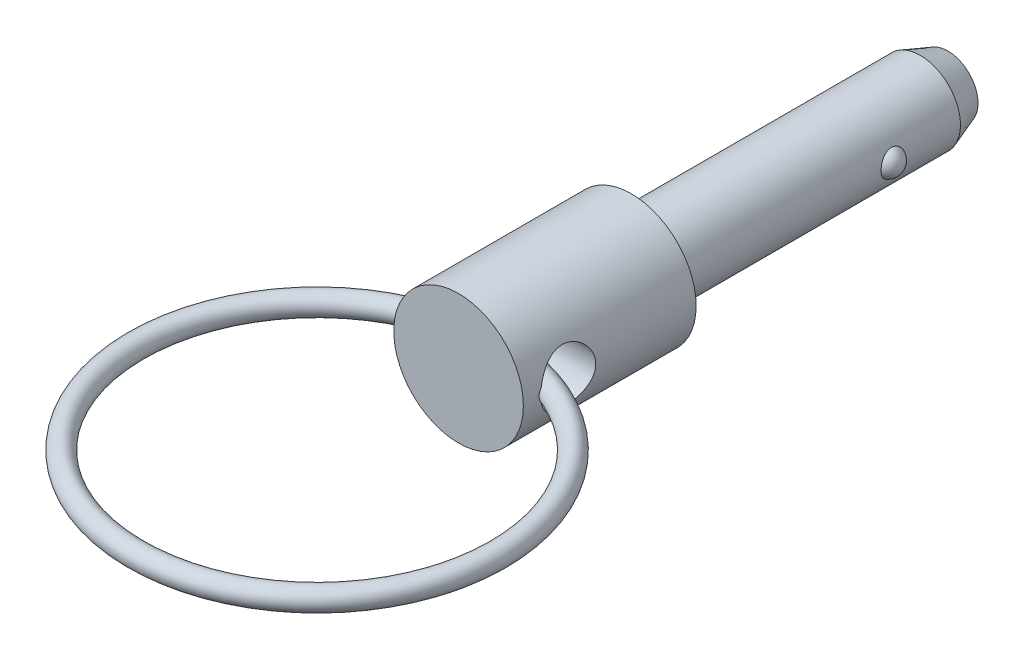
ISO-10303-21;
HEADER;
FILE_DESCRIPTION(('STEP AP214'),'2;1');
FILE_NAME('part.step','',(''),(''),'','','');
FILE_SCHEMA(('AUTOMOTIVE_DESIGN { 1 0 10303 214 1 1 1 1 }'));
ENDSEC;
DATA;
#1=APPLICATION_CONTEXT('core data for automotive mechanical design processes');
#2=APPLICATION_PROTOCOL_DEFINITION('international standard','automotive_design',2000,#1);
#3=PRODUCT_CONTEXT('',#1,'mechanical');
#4=PRODUCT('Part','Part','',(#3));
#5=PRODUCT_RELATED_PRODUCT_CATEGORY('part','',(#4));
#6=PRODUCT_DEFINITION_FORMATION('','',#4);
#7=PRODUCT_DEFINITION_CONTEXT('part definition',#1,'design');
#8=PRODUCT_DEFINITION('design','',#6,#7);
#9=PRODUCT_DEFINITION_SHAPE('','',#8);
#10=(LENGTH_UNIT() NAMED_UNIT(*) SI_UNIT(.MILLI.,.METRE.));
#11=(NAMED_UNIT(*) PLANE_ANGLE_UNIT() SI_UNIT($,.RADIAN.));
#12=(NAMED_UNIT(*) SI_UNIT($,.STERADIAN.) SOLID_ANGLE_UNIT());
#13=UNCERTAINTY_MEASURE_WITH_UNIT(LENGTH_MEASURE(1.E-05),#10,'distance_accuracy_value','');
#14=(GEOMETRIC_REPRESENTATION_CONTEXT(3) GLOBAL_UNCERTAINTY_ASSIGNED_CONTEXT((#13)) GLOBAL_UNIT_ASSIGNED_CONTEXT((#10,
#11,#12)) REPRESENTATION_CONTEXT('',''));
#15=CARTESIAN_POINT('',(0.,0.,0.));
#16=DIRECTION('',(0.,0.,1.));
#17=DIRECTION('',(1.,0.,0.));
#18=AXIS2_PLACEMENT_3D('',#15,#16,#17);
#19=CARTESIAN_POINT('',(6.35,0.,9.398));
#20=DIRECTION('',(-1.,0.,0.));
#21=DIRECTION('',(0.,0.,-1.));
#22=AXIS2_PLACEMENT_3D('',#19,#20,#21);
#23=CYLINDRICAL_SURFACE('',#22,2.0193);
#24=CARTESIAN_POINT('',(-4.76270000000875,0.49815316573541,11.3548893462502));
#25=CARTESIAN_POINT('',(-4.72833190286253,0.475048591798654,11.3607446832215));
#26=CARTESIAN_POINT('',(-4.69505034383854,0.449919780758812,11.3667299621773));
#27=CARTESIAN_POINT('',(-4.63192457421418,0.394832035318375,11.3785339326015));
#28=CARTESIAN_POINT('',(-4.60213511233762,0.364810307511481,11.3843491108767));
#29=CARTESIAN_POINT('',(-4.55535458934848,0.308281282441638,11.3937756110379));
#30=CARTESIAN_POINT('',(-4.53705372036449,0.282907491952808,11.3975656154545));
#31=CARTESIAN_POINT('',(-4.50470768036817,0.229597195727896,11.4043835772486));
#32=CARTESIAN_POINT('',(-4.49064226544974,0.201673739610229,11.4074151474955));
#33=CARTESIAN_POINT('',(-4.46975490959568,0.148629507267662,11.4119668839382));
#34=CARTESIAN_POINT('',(-4.46210314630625,0.123852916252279,11.413657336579));
#35=CARTESIAN_POINT('',(-4.45097170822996,0.0733134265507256,11.4161269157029));
#36=CARTESIAN_POINT('',(-4.4474922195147,0.0475504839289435,11.4169060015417));
#37=CARTESIAN_POINT('',(-4.44500621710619,-0.0042594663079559,11.4174619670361));
#38=CARTESIAN_POINT('',(-4.44600914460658,-0.0303069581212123,11.4172367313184));
#39=CARTESIAN_POINT('',(-4.45241947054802,-0.0818207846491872,11.4158064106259));
#40=CARTESIAN_POINT('',(-4.45782777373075,-0.107286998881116,11.414601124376));
#41=CARTESIAN_POINT('',(-4.47240849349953,-0.156294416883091,11.4113883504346));
#42=CARTESIAN_POINT('',(-4.48147591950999,-0.179868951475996,11.4094032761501));
#43=CARTESIAN_POINT('',(-4.50279050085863,-0.225454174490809,11.404805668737));
#44=CARTESIAN_POINT('',(-4.51503925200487,-0.247464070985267,11.4021928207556));
#45=CARTESIAN_POINT('',(-4.55011891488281,-0.302206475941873,11.394845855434));
#46=CARTESIAN_POINT('',(-4.57493397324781,-0.333621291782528,11.3897686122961));
#47=CARTESIAN_POINT('',(-4.62912866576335,-0.392111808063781,11.3790894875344));
#48=CARTESIAN_POINT('',(-4.65852008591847,-0.419175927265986,11.3734862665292));
#49=CARTESIAN_POINT('',(-4.71307862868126,-0.463335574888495,11.3635175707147));
#50=CARTESIAN_POINT('',(-4.73757440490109,-0.481267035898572,11.3591766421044));
#51=CARTESIAN_POINT('',(-4.76270000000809,-0.498153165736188,11.35488934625));
#52=B_SPLINE_CURVE_WITH_KNOTS('',3,(#24,#25,#26,#27,#28,#29,#30,#31,#32,#33,#34,#35,#36,#37,#38,
#39,#40,#41,#42,#43,#44,#45,#46,#47,#48,#49,#50,#51),.UNSPECIFIED.,.F.,.F.,(4,2,2,2,2,2,2,2,2,2,
2,2,2,4),(0.,0.125801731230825,0.253367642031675,0.347579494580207,0.441333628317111,
0.518959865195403,0.596589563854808,0.674382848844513,0.752192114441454,0.82791171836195,
0.90366937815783,1.02403641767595,1.14471874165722,1.23653238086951),.UNSPECIFIED.);
#53=CARTESIAN_POINT('',(-4.73813099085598,0.481166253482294,11.3591352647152));
#54=VERTEX_POINT('',#53);
#55=CARTESIAN_POINT('',(-4.73813099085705,-0.481166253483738,11.359135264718));
#56=VERTEX_POINT('',#55);
#57=EDGE_CURVE('E39',#54,#56,#52,.T.);
#58=ORIENTED_EDGE('',*,*,#57,.F.);
#59=CARTESIAN_POINT('',(-4.7625,0.,11.4173));
#60=CARTESIAN_POINT('',(-4.76249489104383,-0.108112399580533,11.4172937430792));
#61=CARTESIAN_POINT('',(-4.75878025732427,-0.216312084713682,11.4085747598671));
#62=CARTESIAN_POINT('',(-4.74429807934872,-0.429541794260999,11.3740482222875));
#63=CARTESIAN_POINT('',(-4.73352107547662,-0.534567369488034,11.3482177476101));
#64=CARTESIAN_POINT('',(-4.70606638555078,-0.73815162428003,11.280597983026));
#65=CARTESIAN_POINT('',(-4.68940628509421,-0.836728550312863,11.238856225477));
#66=CARTESIAN_POINT('',(-4.65179514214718,-1.02541561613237,11.1408163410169));
#67=CARTESIAN_POINT('',(-4.63084399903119,-1.11552555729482,11.0845178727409));
#68=CARTESIAN_POINT('',(-4.58553515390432,-1.28946876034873,10.9559107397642));
#69=CARTESIAN_POINT('',(-4.56106355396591,-1.37280723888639,10.8829734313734));
#70=CARTESIAN_POINT('',(-4.51195602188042,-1.52649281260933,10.7244940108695));
#71=CARTESIAN_POINT('',(-4.48732001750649,-1.59683374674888,10.638945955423));
#72=CARTESIAN_POINT('',(-4.43925108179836,-1.7261116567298,10.4523438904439));
#73=CARTESIAN_POINT('',(-4.41594507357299,-1.78427664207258,10.3507188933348));
#74=CARTESIAN_POINT('',(-4.37499469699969,-1.88246618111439,10.1379969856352));
#75=CARTESIAN_POINT('',(-4.35734737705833,-1.92250019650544,10.0269050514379));
#76=CARTESIAN_POINT('',(-4.33095312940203,-1.98122376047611,9.80411364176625));
#77=CARTESIAN_POINT('',(-4.32180970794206,-2.0008697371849,9.69271508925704));
#78=CARTESIAN_POINT('',(-4.31232297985,-2.02124136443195,9.46785625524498));
#79=CARTESIAN_POINT('',(-4.31197457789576,-2.02197796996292,9.35439720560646));
#80=CARTESIAN_POINT('',(-4.31978298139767,-2.00522830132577,9.13832342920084));
#81=CARTESIAN_POINT('',(-4.32726229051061,-1.98919366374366,9.03556669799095));
#82=CARTESIAN_POINT('',(-4.34873498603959,-1.94179810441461,8.83436976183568));
#83=CARTESIAN_POINT('',(-4.36272967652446,-1.91043411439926,8.73593042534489));
#84=CARTESIAN_POINT('',(-4.39597564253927,-1.83265370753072,8.54363008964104));
#85=CARTESIAN_POINT('',(-4.41533413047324,-1.7859262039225,8.44991428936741));
#86=CARTESIAN_POINT('',(-4.45710273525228,-1.67896759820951,8.27128429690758));
#87=CARTESIAN_POINT('',(-4.47951396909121,-1.61873154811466,8.1863733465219));
#88=CARTESIAN_POINT('',(-4.52725353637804,-1.48026834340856,8.0199216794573));
#89=CARTESIAN_POINT('',(-4.55266534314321,-1.40092677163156,7.93932933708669));
#90=CARTESIAN_POINT('',(-4.60189767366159,-1.22958667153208,7.79224755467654));
#91=CARTESIAN_POINT('',(-4.62571737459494,-1.13758167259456,7.72576536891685));
#92=CARTESIAN_POINT('',(-4.66982369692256,-0.94052978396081,7.6073238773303));
#93=CARTESIAN_POINT('',(-4.69000583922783,-0.835212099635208,7.55577397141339));
#94=CARTESIAN_POINT('',(-4.72372878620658,-0.616416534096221,7.47153070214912));
#95=CARTESIAN_POINT('',(-4.73728278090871,-0.502955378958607,7.43879986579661));
#96=CARTESIAN_POINT('',(-4.75192155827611,-0.323662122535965,7.40374908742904));
#97=CARTESIAN_POINT('',(-4.75587275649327,-0.259363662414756,7.39437239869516));
#98=CARTESIAN_POINT('',(-4.76116348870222,-0.130053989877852,7.38184603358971));
#99=CARTESIAN_POINT('',(-4.76250307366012,-0.0650427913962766,7.3786962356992));
#100=CARTESIAN_POINT('',(-4.76249489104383,0.10811239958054,7.37870625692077));
#101=CARTESIAN_POINT('',(-4.75878025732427,0.21631208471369,7.38742524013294));
#102=CARTESIAN_POINT('',(-4.74429807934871,0.429541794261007,7.42195177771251));
#103=CARTESIAN_POINT('',(-4.73352107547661,0.534567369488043,7.44778225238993));
#104=CARTESIAN_POINT('',(-4.70606638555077,0.738151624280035,7.51540201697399));
#105=CARTESIAN_POINT('',(-4.68940628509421,0.836728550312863,7.55714377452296));
#106=CARTESIAN_POINT('',(-4.65179514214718,1.02541561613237,7.65518365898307));
#107=CARTESIAN_POINT('',(-4.63084399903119,1.11552555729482,7.71148212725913));
#108=CARTESIAN_POINT('',(-4.58553515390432,1.28946876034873,7.84008926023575));
#109=CARTESIAN_POINT('',(-4.56106355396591,1.37280723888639,7.91302656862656));
#110=CARTESIAN_POINT('',(-4.51195602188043,1.52649281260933,8.07150598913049));
#111=CARTESIAN_POINT('',(-4.48732001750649,1.59683374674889,8.15705404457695));
#112=CARTESIAN_POINT('',(-4.43925108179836,1.7261116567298,8.3436561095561));
#113=CARTESIAN_POINT('',(-4.41594507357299,1.78427664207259,8.44528110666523));
#114=CARTESIAN_POINT('',(-4.37499469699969,1.88246618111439,8.65800301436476));
#115=CARTESIAN_POINT('',(-4.35734737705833,1.92250019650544,8.76909494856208));
#116=CARTESIAN_POINT('',(-4.33095312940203,1.98122376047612,8.99188635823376));
#117=CARTESIAN_POINT('',(-4.32180970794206,2.00086973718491,9.10328491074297));
#118=CARTESIAN_POINT('',(-4.31232297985,2.02124136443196,9.32814374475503));
#119=CARTESIAN_POINT('',(-4.31197457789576,2.02197796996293,9.44160279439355));
#120=CARTESIAN_POINT('',(-4.31978298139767,2.00522830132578,9.65767657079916));
#121=CARTESIAN_POINT('',(-4.32726229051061,1.98919366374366,9.76043330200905));
#122=CARTESIAN_POINT('',(-4.34873498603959,1.94179810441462,9.96163023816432));
#123=CARTESIAN_POINT('',(-4.36272967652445,1.91043411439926,10.0600695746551));
#124=CARTESIAN_POINT('',(-4.39597564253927,1.83265370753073,10.252369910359));
#125=CARTESIAN_POINT('',(-4.41533413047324,1.78592620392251,10.3460857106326));
#126=CARTESIAN_POINT('',(-4.45710273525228,1.67896759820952,10.5247157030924));
#127=CARTESIAN_POINT('',(-4.47951396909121,1.61873154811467,10.6096266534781));
#128=CARTESIAN_POINT('',(-4.52725353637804,1.48026834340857,10.7760783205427));
#129=CARTESIAN_POINT('',(-4.55266534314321,1.40092677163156,10.8566706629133));
#130=CARTESIAN_POINT('',(-4.60189767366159,1.22958667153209,11.0037524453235));
#131=CARTESIAN_POINT('',(-4.62571737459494,1.13758167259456,11.0702346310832));
#132=CARTESIAN_POINT('',(-4.66982369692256,0.940529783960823,11.1886761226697));
#133=CARTESIAN_POINT('',(-4.69000583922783,0.835212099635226,11.2402260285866));
#134=CARTESIAN_POINT('',(-4.72372878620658,0.616416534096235,11.3244692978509));
#135=CARTESIAN_POINT('',(-4.73728278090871,0.502955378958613,11.3572001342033));
#136=CARTESIAN_POINT('',(-4.75192155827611,0.323662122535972,11.3922509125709));
#137=CARTESIAN_POINT('',(-4.75587275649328,0.259363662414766,11.4016276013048));
#138=CARTESIAN_POINT('',(-4.76116348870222,0.130053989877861,11.4141539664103));
#139=CARTESIAN_POINT('',(-4.76250307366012,0.0650427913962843,11.4173037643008));
#140=CARTESIAN_POINT('',(-4.7625,0.,11.4173));
#141=B_SPLINE_CURVE_WITH_KNOTS('',3,(#59,#60,#61,#62,#63,#64,#65,#66,#67,#68,#69,#70,#71,#72,
#73,#74,#75,#76,#77,#78,#79,#80,#81,#82,#83,#84,#85,#86,#87,#88,#89,#90,#91,#92,#93,#94,#95,#96,
#97,#98,#99,#100,#101,#102,#103,#104,#105,#106,#107,#108,#109,#110,#111,#112,#113,#114,#115,
#116,#117,#118,#119,#120,#121,#122,#123,#124,#125,#126,#127,#128,#129,#130,#131,#132,#133,#134,
#135,#136,#137,#138,#139,#140),.UNSPECIFIED.,.T.,.F.,(4,2,2,2,2,2,2,2,2,2,2,2,2,2,2,2,2,2,2,2,2,
2,2,2,2,2,2,2,2,2,2,2,2,2,2,2,2,2,2,2,4),(0.,0.324084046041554,0.648603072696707,
0.972160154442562,1.29572482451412,1.63451297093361,1.97346129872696,2.32983137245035,
2.68601525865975,3.02460962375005,3.36300782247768,3.6743618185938,3.98577815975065,
4.30393445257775,4.6222074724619,4.96838833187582,5.31474674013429,5.66985671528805,
6.02425711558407,6.21923699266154,6.41421306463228,6.73829711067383,7.06281613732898,
7.38637321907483,7.70993788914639,8.04872603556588,8.38767436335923,8.74404443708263,
9.10022832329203,9.43882268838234,9.77722088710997,10.0885748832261,10.3999912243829,
10.71814751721,11.0364205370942,11.3826013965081,11.7289598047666,12.0840697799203,
12.4384701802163,12.6334500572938,12.8284261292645),.UNSPECIFIED.);
#142=EDGE_CURVE('E53',#56,#54,#141,.T.);
#143=ORIENTED_EDGE('',*,*,#142,.F.);
#144=EDGE_LOOP('',(#58,#143));
#145=FACE_BOUND('',#144,.T.);
#146=CARTESIAN_POINT('',(4.76270000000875,-0.498153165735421,11.3548893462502));
#147=CARTESIAN_POINT('',(4.72833190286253,-0.475048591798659,11.3607446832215));
#148=CARTESIAN_POINT('',(4.69505034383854,-0.449919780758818,11.3667299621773));
#149=CARTESIAN_POINT('',(4.63192457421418,-0.394832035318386,11.3785339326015));
#150=CARTESIAN_POINT('',(4.60213511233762,-0.364810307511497,11.3843491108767));
#151=CARTESIAN_POINT('',(4.55535458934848,-0.308281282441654,11.3937756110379));
#152=CARTESIAN_POINT('',(4.53705372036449,-0.282907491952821,11.3975656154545));
#153=CARTESIAN_POINT('',(4.50470768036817,-0.229597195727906,11.4043835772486));
#154=CARTESIAN_POINT('',(4.49064226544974,-0.201673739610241,11.4074151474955));
#155=CARTESIAN_POINT('',(4.46975490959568,-0.148629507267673,11.4119668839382));
#156=CARTESIAN_POINT('',(4.46210314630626,-0.123852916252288,11.413657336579));
#157=CARTESIAN_POINT('',(4.45097170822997,-0.0733134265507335,11.4161269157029));
#158=CARTESIAN_POINT('',(4.44749221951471,-0.0475504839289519,11.4169060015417));
#159=CARTESIAN_POINT('',(4.44500621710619,0.00425946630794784,11.4174619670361));
#160=CARTESIAN_POINT('',(4.44600914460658,0.030306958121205,11.4172367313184));
#161=CARTESIAN_POINT('',(4.45241947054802,0.0818207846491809,11.4158064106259));
#162=CARTESIAN_POINT('',(4.45782777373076,0.107286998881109,11.414601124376));
#163=CARTESIAN_POINT('',(4.47240849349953,0.156294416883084,11.4113883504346));
#164=CARTESIAN_POINT('',(4.48147591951,0.179868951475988,11.4094032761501));
#165=CARTESIAN_POINT('',(4.50279050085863,0.225454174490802,11.404805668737));
#166=CARTESIAN_POINT('',(4.51503925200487,0.247464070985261,11.4021928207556));
#167=CARTESIAN_POINT('',(4.55011891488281,0.302206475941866,11.394845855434));
#168=CARTESIAN_POINT('',(4.57493397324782,0.333621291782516,11.3897686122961));
#169=CARTESIAN_POINT('',(4.62912866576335,0.392111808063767,11.3790894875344));
#170=CARTESIAN_POINT('',(4.65852008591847,0.419175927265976,11.3734862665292));
#171=CARTESIAN_POINT('',(4.71307862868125,0.463335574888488,11.3635175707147));
#172=CARTESIAN_POINT('',(4.73757440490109,0.481267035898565,11.3591766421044));
#173=CARTESIAN_POINT('',(4.76270000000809,0.498153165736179,11.3548893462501));
#174=B_SPLINE_CURVE_WITH_KNOTS('',3,(#146,#147,#148,#149,#150,#151,#152,#153,#154,#155,#156,
#157,#158,#159,#160,#161,#162,#163,#164,#165,#166,#167,#168,#169,#170,#171,#172,#173),
.UNSPECIFIED.,.F.,.F.,(4,2,2,2,2,2,2,2,2,2,2,2,2,4),(0.,0.125801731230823,0.253367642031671,
0.347579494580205,0.44133362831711,0.518959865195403,0.596589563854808,0.674382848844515,
0.752192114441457,0.827911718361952,0.903669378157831,1.02403641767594,1.14471874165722,
1.2365323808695),.UNSPECIFIED.);
#175=CARTESIAN_POINT('',(4.73813099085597,-0.481166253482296,11.3591352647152));
#176=VERTEX_POINT('',#175);
#177=CARTESIAN_POINT('',(4.73813099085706,0.481166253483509,11.359135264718));
#178=VERTEX_POINT('',#177);
#179=EDGE_CURVE('E32',#176,#178,#174,.T.);
#180=ORIENTED_EDGE('',*,*,#179,.F.);
#181=CARTESIAN_POINT('',(4.7625,0.,7.3787));
#182=CARTESIAN_POINT('',(4.76249489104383,-0.108112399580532,7.37870625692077));
#183=CARTESIAN_POINT('',(4.75878025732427,-0.216312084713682,7.38742524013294));
#184=CARTESIAN_POINT('',(4.74429807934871,-0.429541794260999,7.42195177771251));
#185=CARTESIAN_POINT('',(4.73352107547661,-0.534567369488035,7.44778225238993));
#186=CARTESIAN_POINT('',(4.70606638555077,-0.738151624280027,7.51540201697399));
#187=CARTESIAN_POINT('',(4.68940628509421,-0.836728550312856,7.55714377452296));
#188=CARTESIAN_POINT('',(4.65179514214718,-1.02541561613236,7.65518365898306));
#189=CARTESIAN_POINT('',(4.63084399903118,-1.11552555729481,7.71148212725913));
#190=CARTESIAN_POINT('',(4.58553515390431,-1.28946876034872,7.84008926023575));
#191=CARTESIAN_POINT('',(4.5610635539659,-1.37280723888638,7.91302656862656));
#192=CARTESIAN_POINT('',(4.51195602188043,-1.52649281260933,8.0715059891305));
#193=CARTESIAN_POINT('',(4.48732001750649,-1.59683374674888,8.15705404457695));
#194=CARTESIAN_POINT('',(4.43925108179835,-1.7261116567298,8.3436561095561));
#195=CARTESIAN_POINT('',(4.41594507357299,-1.78427664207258,8.44528110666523));
#196=CARTESIAN_POINT('',(4.37499469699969,-1.88246618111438,8.65800301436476));
#197=CARTESIAN_POINT('',(4.35734737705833,-1.92250019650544,8.76909494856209));
#198=CARTESIAN_POINT('',(4.33095312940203,-1.98122376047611,8.99188635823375));
#199=CARTESIAN_POINT('',(4.32180970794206,-2.0008697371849,9.10328491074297));
#200=CARTESIAN_POINT('',(4.31232297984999,-2.02124136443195,9.32814374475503));
#201=CARTESIAN_POINT('',(4.31197457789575,-2.02197796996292,9.44160279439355));
#202=CARTESIAN_POINT('',(4.31978298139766,-2.00522830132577,9.65767657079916));
#203=CARTESIAN_POINT('',(4.32726229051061,-1.98919366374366,9.76043330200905));
#204=CARTESIAN_POINT('',(4.34873498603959,-1.94179810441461,9.96163023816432));
#205=CARTESIAN_POINT('',(4.36272967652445,-1.91043411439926,10.0600695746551));
#206=CARTESIAN_POINT('',(4.39597564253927,-1.83265370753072,10.252369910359));
#207=CARTESIAN_POINT('',(4.41533413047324,-1.7859262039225,10.3460857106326));
#208=CARTESIAN_POINT('',(4.45710273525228,-1.67896759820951,10.5247157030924));
#209=CARTESIAN_POINT('',(4.4795139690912,-1.61873154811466,10.6096266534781));
#210=CARTESIAN_POINT('',(4.52725353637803,-1.48026834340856,10.7760783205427));
#211=CARTESIAN_POINT('',(4.55266534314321,-1.40092677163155,10.8566706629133));
#212=CARTESIAN_POINT('',(4.60189767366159,-1.22958667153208,11.0037524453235));
#213=CARTESIAN_POINT('',(4.62571737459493,-1.13758167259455,11.0702346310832));
#214=CARTESIAN_POINT('',(4.66982369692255,-0.940529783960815,11.1886761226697));
#215=CARTESIAN_POINT('',(4.69000583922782,-0.835212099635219,11.2402260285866));
#216=CARTESIAN_POINT('',(4.72372878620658,-0.616416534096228,11.3244692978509));
#217=CARTESIAN_POINT('',(4.7372827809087,-0.502955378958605,11.3572001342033));
#218=CARTESIAN_POINT('',(4.75192155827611,-0.323662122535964,11.3922509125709));
#219=CARTESIAN_POINT('',(4.75587275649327,-0.259363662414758,11.4016276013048));
#220=CARTESIAN_POINT('',(4.76116348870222,-0.130053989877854,11.4141539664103));
#221=CARTESIAN_POINT('',(4.76250307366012,-0.0650427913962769,11.4173037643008));
#222=CARTESIAN_POINT('',(4.76249489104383,0.108112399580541,11.4172937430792));
#223=CARTESIAN_POINT('',(4.75878025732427,0.21631208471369,11.4085747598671));
#224=CARTESIAN_POINT('',(4.74429807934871,0.429541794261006,11.3740482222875));
#225=CARTESIAN_POINT('',(4.73352107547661,0.534567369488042,11.3482177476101));
#226=CARTESIAN_POINT('',(4.70606638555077,0.738151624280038,11.280597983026));
#227=CARTESIAN_POINT('',(4.68940628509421,0.836728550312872,11.238856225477));
#228=CARTESIAN_POINT('',(4.65179514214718,1.02541561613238,11.1408163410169));
#229=CARTESIAN_POINT('',(4.63084399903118,1.11552555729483,11.0845178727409));
#230=CARTESIAN_POINT('',(4.58553515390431,1.28946876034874,10.9559107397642));
#231=CARTESIAN_POINT('',(4.5610635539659,1.3728072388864,10.8829734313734));
#232=CARTESIAN_POINT('',(4.51195602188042,1.52649281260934,10.7244940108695));
#233=CARTESIAN_POINT('',(4.48732001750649,1.59683374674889,10.638945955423));
#234=CARTESIAN_POINT('',(4.43925108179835,1.72611165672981,10.4523438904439));
#235=CARTESIAN_POINT('',(4.41594507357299,1.78427664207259,10.3507188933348));
#236=CARTESIAN_POINT('',(4.37499469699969,1.88246618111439,10.1379969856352));
#237=CARTESIAN_POINT('',(4.35734737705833,1.92250019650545,10.0269050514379));
#238=CARTESIAN_POINT('',(4.33095312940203,1.98122376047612,9.80411364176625));
#239=CARTESIAN_POINT('',(4.32180970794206,2.00086973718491,9.69271508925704));
#240=CARTESIAN_POINT('',(4.31232297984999,2.02124136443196,9.46785625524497));
#241=CARTESIAN_POINT('',(4.31197457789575,2.02197796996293,9.35439720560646));
#242=CARTESIAN_POINT('',(4.31978298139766,2.00522830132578,9.13832342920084));
#243=CARTESIAN_POINT('',(4.32726229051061,1.98919366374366,9.03556669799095));
#244=CARTESIAN_POINT('',(4.34873498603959,1.94179810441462,8.83436976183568));
#245=CARTESIAN_POINT('',(4.36272967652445,1.91043411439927,8.73593042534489));
#246=CARTESIAN_POINT('',(4.39597564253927,1.83265370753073,8.54363008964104));
#247=CARTESIAN_POINT('',(4.41533413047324,1.7859262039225,8.44991428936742));
#248=CARTESIAN_POINT('',(4.45710273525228,1.67896759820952,8.27128429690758));
#249=CARTESIAN_POINT('',(4.47951396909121,1.61873154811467,8.1863733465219));
#250=CARTESIAN_POINT('',(4.52725353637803,1.48026834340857,8.0199216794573));
#251=CARTESIAN_POINT('',(4.55266534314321,1.40092677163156,7.93932933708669));
#252=CARTESIAN_POINT('',(4.60189767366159,1.22958667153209,7.79224755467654));
#253=CARTESIAN_POINT('',(4.62571737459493,1.13758167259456,7.72576536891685));
#254=CARTESIAN_POINT('',(4.66982369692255,0.940529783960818,7.6073238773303));
#255=CARTESIAN_POINT('',(4.69000583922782,0.835212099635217,7.55577397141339));
#256=CARTESIAN_POINT('',(4.72372878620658,0.616416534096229,7.47153070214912));
#257=CARTESIAN_POINT('',(4.7372827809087,0.502955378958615,7.43879986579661));
#258=CARTESIAN_POINT('',(4.75192155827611,0.323662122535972,7.40374908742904));
#259=CARTESIAN_POINT('',(4.75587275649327,0.259363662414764,7.39437239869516));
#260=CARTESIAN_POINT('',(4.76116348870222,0.130053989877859,7.38184603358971));
#261=CARTESIAN_POINT('',(4.76250307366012,0.0650427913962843,7.3786962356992));
#262=CARTESIAN_POINT('',(4.7625,0.,7.3787));
#263=B_SPLINE_CURVE_WITH_KNOTS('',3,(#181,#182,#183,#184,#185,#186,#187,#188,#189,#190,#191,
#192,#193,#194,#195,#196,#197,#198,#199,#200,#201,#202,#203,#204,#205,#206,#207,#208,#209,#210,
#211,#212,#213,#214,#215,#216,#217,#218,#219,#220,#221,#222,#223,#224,#225,#226,#227,#228,#229,
#230,#231,#232,#233,#234,#235,#236,#237,#238,#239,#240,#241,#242,#243,#244,#245,#246,#247,#248,
#249,#250,#251,#252,#253,#254,#255,#256,#257,#258,#259,#260,#261,#262),.UNSPECIFIED.,.T.,.F.,(4,
2,2,2,2,2,2,2,2,2,2,2,2,2,2,2,2,2,2,2,2,2,2,2,2,2,2,2,2,2,2,2,2,2,2,2,2,2,2,2,4),(0.,
0.324084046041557,0.648603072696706,0.972160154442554,1.29572482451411,1.63451297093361,
1.97346129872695,2.32983137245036,2.68601525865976,3.02460962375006,3.3630078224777,
3.6743618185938,3.98577815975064,4.30393445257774,4.6222074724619,4.96838833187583,
5.31474674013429,5.66985671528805,6.02425711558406,6.21923699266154,6.41421306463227,
6.73829711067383,7.06281613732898,7.38637321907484,7.7099378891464,8.04872603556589,
8.38767436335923,8.74404443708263,9.10022832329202,9.43882268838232,9.77722088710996,
10.0885748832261,10.3999912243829,10.71814751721,11.0364205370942,11.3826013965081,
11.7289598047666,12.0840697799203,12.4384701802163,12.6334500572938,12.8284261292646),.UNSPECIFIED.);
#264=EDGE_CURVE('E49',#178,#176,#263,.T.);
#265=ORIENTED_EDGE('',*,*,#264,.F.);
#266=EDGE_LOOP('',(#180,#265));
#267=FACE_BOUND('',#266,.T.);
#268=ADVANCED_FACE('F14',(#145,#267),#23,.F.);
#269=CARTESIAN_POINT('',(0.,0.,-23.2664));
#270=DIRECTION('',(0.,0.,-1.));
#271=DIRECTION('',(1.,0.,0.));
#272=AXIS2_PLACEMENT_3D('',#269,#270,#271);
#273=CYLINDRICAL_SURFACE('',#272,4.7625);
#274=ORIENTED_EDGE('',*,*,#264,.T.);
#275=CARTESIAN_POINT('',(4.75672783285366,-0.234410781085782,9.86389096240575));
#276=CARTESIAN_POINT('',(4.75463715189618,-0.276823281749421,9.87695364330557));
#277=CARTESIAN_POINT('',(4.75202741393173,-0.318142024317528,9.89358560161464));
#278=CARTESIAN_POINT('',(4.74605906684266,-0.397384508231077,9.93354154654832));
#279=CARTESIAN_POINT('',(4.74269965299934,-0.435304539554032,9.95687273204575));
#280=CARTESIAN_POINT('',(4.7356117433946,-0.506628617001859,10.0095466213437));
#281=CARTESIAN_POINT('',(4.731883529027,-0.540036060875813,10.0388847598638));
#282=CARTESIAN_POINT('',(4.7244690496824,-0.601463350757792,10.1027270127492));
#283=CARTESIAN_POINT('',(4.72078277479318,-0.629484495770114,10.1372298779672));
#284=CARTESIAN_POINT('',(4.71381973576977,-0.679675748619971,10.2106969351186));
#285=CARTESIAN_POINT('',(4.71054647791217,-0.70179733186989,10.2496945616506));
#286=CARTESIAN_POINT('',(4.70478201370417,-0.73945712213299,10.3307970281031));
#287=CARTESIAN_POINT('',(4.7022909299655,-0.754994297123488,10.3729023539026));
#288=CARTESIAN_POINT('',(4.69825743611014,-0.77970948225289,10.4605198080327));
#289=CARTESIAN_POINT('',(4.69674995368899,-0.788654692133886,10.5060989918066));
#290=CARTESIAN_POINT('',(4.69494168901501,-0.799348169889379,10.5981124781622));
#291=CARTESIAN_POINT('',(4.69464124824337,-0.801094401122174,10.6445470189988));
#292=CARTESIAN_POINT('',(4.69525593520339,-0.797484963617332,10.7400273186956));
#293=CARTESIAN_POINT('',(4.6962479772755,-0.7916799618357,10.7890554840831));
#294=CARTESIAN_POINT('',(4.69943436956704,-0.772538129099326,10.88558205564));
#295=CARTESIAN_POINT('',(4.70162918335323,-0.759198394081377,10.9330798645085));
#296=CARTESIAN_POINT('',(4.7071366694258,-0.724294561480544,11.0283694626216));
#297=CARTESIAN_POINT('',(4.71051187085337,-0.702258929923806,11.0759856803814));
#298=CARTESIAN_POINT('',(4.71792781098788,-0.6505714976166,11.1668661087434));
#299=CARTESIAN_POINT('',(4.72196879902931,-0.620916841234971,11.2101286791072));
#300=CARTESIAN_POINT('',(4.73024120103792,-0.554392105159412,11.2909794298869));
#301=CARTESIAN_POINT('',(4.73447324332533,-0.517496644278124,11.3285468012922));
#302=CARTESIAN_POINT('',(4.74255290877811,-0.437280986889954,11.3961281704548));
#303=CARTESIAN_POINT('',(4.74640083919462,-0.393965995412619,11.4261482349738));
#304=CARTESIAN_POINT('',(4.75279848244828,-0.306647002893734,11.4743172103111));
#305=CARTESIAN_POINT('',(4.7554392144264,-0.263139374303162,11.4933494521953));
#306=CARTESIAN_POINT('',(4.75956072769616,-0.173210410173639,11.5225838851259));
#307=CARTESIAN_POINT('',(4.7610430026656,-0.126792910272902,11.5327974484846));
#308=CARTESIAN_POINT('',(4.76251214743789,-0.0392228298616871,11.5429046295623));
#309=CARTESIAN_POINT('',(4.76267454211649,0.00179015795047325,11.5440098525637));
#310=CARTESIAN_POINT('',(4.76194485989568,0.0833582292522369,11.5390051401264));
#311=CARTESIAN_POINT('',(4.76105302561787,0.123913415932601,11.5328968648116));
#312=CARTESIAN_POINT('',(4.75839052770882,0.201390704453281,11.5143023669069));
#313=CARTESIAN_POINT('',(4.7566647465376,0.23839356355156,11.5021410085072));
#314=CARTESIAN_POINT('',(4.75253498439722,0.310009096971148,11.4722173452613));
#315=CARTESIAN_POINT('',(4.75013086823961,0.34462129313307,11.4544539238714));
#316=CARTESIAN_POINT('',(4.74468244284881,0.413106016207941,11.4126354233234));
#317=CARTESIAN_POINT('',(4.74160529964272,0.446760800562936,11.3882294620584));
#318=CARTESIAN_POINT('',(4.73521429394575,0.510064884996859,11.3347169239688));
#319=CARTESIAN_POINT('',(4.73190032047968,0.539712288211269,11.3056081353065));
#320=CARTESIAN_POINT('',(4.72489226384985,0.598141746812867,11.2395451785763));
#321=CARTESIAN_POINT('',(4.72120374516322,0.626328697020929,11.2020637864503));
#322=CARTESIAN_POINT('',(4.71424234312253,0.676737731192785,11.1232450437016));
#323=CARTESIAN_POINT('',(4.71096968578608,0.698956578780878,11.0819056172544));
#324=CARTESIAN_POINT('',(4.70485086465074,0.739081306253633,10.9918449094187));
#325=CARTESIAN_POINT('',(4.70208579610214,0.756287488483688,10.9428045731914));
#326=CARTESIAN_POINT('',(4.69779376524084,0.782507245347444,10.8425158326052));
#327=CARTESIAN_POINT('',(4.69626707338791,0.791519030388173,10.7912669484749));
#328=CARTESIAN_POINT('',(4.69466144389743,0.800990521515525,10.6869325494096));
#329=CARTESIAN_POINT('',(4.69461132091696,0.801280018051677,10.6338307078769));
#330=CARTESIAN_POINT('',(4.69610058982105,0.792506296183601,10.5284214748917));
#331=CARTESIAN_POINT('',(4.69763938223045,0.783446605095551,10.4761137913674));
#332=CARTESIAN_POINT('',(4.70202301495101,0.756674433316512,10.3770218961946));
#333=CARTESIAN_POINT('',(4.70478816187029,0.739486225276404,10.3300928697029));
#334=CARTESIAN_POINT('',(4.71127399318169,0.696967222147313,10.2401511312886));
#335=CARTESIAN_POINT('',(4.71499427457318,0.671639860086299,10.1971367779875));
#336=CARTESIAN_POINT('',(4.72264431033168,0.615452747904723,10.1192841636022));
#337=CARTESIAN_POINT('',(4.72654308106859,0.585080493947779,10.0840903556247));
#338=CARTESIAN_POINT('',(4.73429341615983,0.518639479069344,10.0195645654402));
#339=CARTESIAN_POINT('',(4.73814499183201,0.482572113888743,9.99023115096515));
#340=CARTESIAN_POINT('',(4.74520575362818,0.407195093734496,9.93927752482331));
#341=CARTESIAN_POINT('',(4.74843306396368,0.368048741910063,9.91741780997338));
#342=CARTESIAN_POINT('',(4.75404590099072,0.286564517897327,9.88060848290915));
#343=CARTESIAN_POINT('',(4.75643129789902,0.244226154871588,9.86565993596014));
#344=CARTESIAN_POINT('',(4.76007108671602,0.15802691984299,9.84320151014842));
#345=CARTESIAN_POINT('',(4.76133640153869,0.114185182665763,9.8356197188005));
#346=CARTESIAN_POINT('',(4.76263391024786,0.0258666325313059,9.82784590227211));
#347=CARTESIAN_POINT('',(4.76266746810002,-0.0186094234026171,9.82764570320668));
#348=CARTESIAN_POINT('',(4.76170334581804,-0.0918724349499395,9.83342133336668));
#349=CARTESIAN_POINT('',(4.76105293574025,-0.12084461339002,9.83731729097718));
#350=CARTESIAN_POINT('',(4.75925240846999,-0.178172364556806,9.84825826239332));
#351=CARTESIAN_POINT('',(4.7581022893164,-0.206527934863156,9.85530328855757));
#352=CARTESIAN_POINT('',(4.75672783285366,-0.234410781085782,9.86389096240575));
#353=B_SPLINE_CURVE_WITH_KNOTS('',3,(#275,#276,#277,#278,#279,#280,#281,#282,#283,#284,#285,
#286,#287,#288,#289,#290,#291,#292,#293,#294,#295,#296,#297,#298,#299,#300,#301,#302,#303,#304,
#305,#306,#307,#308,#309,#310,#311,#312,#313,#314,#315,#316,#317,#318,#319,#320,#321,#322,#323,
#324,#325,#326,#327,#328,#329,#330,#331,#332,#333,#334,#335,#336,#337,#338,#339,#340,#341,#342,
#343,#344,#345,#346,#347,#348,#349,#350,#351,#352),.UNSPECIFIED.,.T.,.F.,(4,2,2,2,2,2,2,2,2,2,2,
2,2,2,2,2,2,2,2,2,2,2,2,2,2,2,2,2,2,2,2,2,2,2,2,2,2,2,4),(0.,0.133176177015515,
0.266496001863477,0.399714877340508,0.532901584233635,0.667152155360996,0.801423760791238,
0.940235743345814,1.07908699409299,1.22659070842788,1.37415131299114,1.53115159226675,
1.68821080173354,1.84583071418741,2.00332351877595,2.14516294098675,2.28681917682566,
2.4092664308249,2.53168551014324,2.64814679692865,2.76463131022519,2.88919364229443,
3.01381473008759,3.15436663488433,3.29499460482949,3.45041783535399,3.60587500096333,
3.76436388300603,3.92279299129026,4.07216500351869,4.22147409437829,4.36072714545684,
4.49994612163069,4.63415709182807,4.76838874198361,4.90129648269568,5.03405704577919,
5.12160944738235,5.20916219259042),.UNSPECIFIED.);
#354=EDGE_CURVE('E26',#176,#178,#353,.T.);
#355=ORIENTED_EDGE('',*,*,#354,.T.);
#356=EDGE_LOOP('',(#274,#355));
#357=FACE_BOUND('',#356,.T.);
#358=CARTESIAN_POINT('',(0.,0.,1.13485609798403E-11));
#359=DIRECTION('',(0.,0.,-1.));
#360=DIRECTION('',(1.,0.,0.));
#361=AXIS2_PLACEMENT_3D('',#358,#359,#360);
#362=CIRCLE('',#361,4.76249999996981);
#363=CARTESIAN_POINT('',(4.76249999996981,0.,1.13483510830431E-11));
#364=VERTEX_POINT('',#363);
#365=EDGE_CURVE('E58',#364,#364,#362,.T.);
#366=ORIENTED_EDGE('',*,*,#365,.F.);
#367=EDGE_LOOP('',(#366));
#368=FACE_BOUND('',#367,.T.);
#369=CARTESIAN_POINT('',(0.,0.,12.7000000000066));
#370=DIRECTION('',(0.,0.,-1.));
#371=DIRECTION('',(1.,0.,0.));
#372=AXIS2_PLACEMENT_3D('',#369,#370,#371);
#373=CIRCLE('',#372,4.76249999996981);
#374=CARTESIAN_POINT('',(4.76249999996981,0.,12.7000000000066));
#375=VERTEX_POINT('',#374);
#376=EDGE_CURVE('E135',#375,#375,#373,.T.);
#377=ORIENTED_EDGE('',*,*,#376,.T.);
#378=EDGE_LOOP('',(#377));
#379=FACE_BOUND('',#378,.T.);
#380=ORIENTED_EDGE('',*,*,#142,.T.);
#381=CARTESIAN_POINT('',(-4.75672783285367,-0.234410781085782,9.86389096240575));
#382=CARTESIAN_POINT('',(-4.75880797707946,-0.192184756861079,9.85088943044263));
#383=CARTESIAN_POINT('',(-4.76037619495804,-0.148820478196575,9.84140883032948));
#384=CARTESIAN_POINT('',(-4.76231114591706,-0.0610623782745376,9.8297605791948));
#385=CARTESIAN_POINT('',(-4.76267662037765,-0.0166675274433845,9.82760058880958));
#386=CARTESIAN_POINT('',(-4.76216356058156,0.0718447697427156,9.83066350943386));
#387=CARTESIAN_POINT('',(-4.76128553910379,0.115962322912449,9.83588337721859));
#388=CARTESIAN_POINT('',(-4.75838343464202,0.202671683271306,9.85356395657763));
#389=CARTESIAN_POINT('',(-4.75635960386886,0.24526382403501,9.86602307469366));
#390=CARTESIAN_POINT('',(-4.75138989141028,0.327732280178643,9.89785096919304));
#391=CARTESIAN_POINT('',(-4.74844388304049,0.367608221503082,9.91722069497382));
#392=CARTESIAN_POINT('',(-4.74195662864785,0.443516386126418,9.96233891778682));
#393=CARTESIAN_POINT('',(-4.73841538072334,0.479548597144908,9.98808743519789));
#394=CARTESIAN_POINT('',(-4.73111995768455,0.546865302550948,10.0453065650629));
#395=CARTESIAN_POINT('',(-4.72736528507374,0.578138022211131,10.0767909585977));
#396=CARTESIAN_POINT('',(-4.72006096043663,0.635024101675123,10.1445276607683));
#397=CARTESIAN_POINT('',(-4.71651131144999,0.660637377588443,10.1807800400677));
#398=CARTESIAN_POINT('',(-4.70994476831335,0.705946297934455,10.2575433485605));
#399=CARTESIAN_POINT('',(-4.70693606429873,0.725553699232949,10.2981069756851));
#400=CARTESIAN_POINT('',(-4.70181675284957,0.758021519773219,10.3818966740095));
#401=CARTESIAN_POINT('',(-4.69970628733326,0.770880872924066,10.4251231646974));
#402=CARTESIAN_POINT('',(-4.69650867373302,0.790134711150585,10.5148288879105));
#403=CARTESIAN_POINT('',(-4.69546563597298,0.796251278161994,10.5613691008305));
#404=CARTESIAN_POINT('',(-4.69462220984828,0.801207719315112,10.6548424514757));
#405=CARTESIAN_POINT('',(-4.69482220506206,0.800045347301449,10.7017757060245));
#406=CARTESIAN_POINT('',(-4.69645733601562,0.790392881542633,10.7979976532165));
#407=CARTESIAN_POINT('',(-4.69797327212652,0.781423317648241,10.8472368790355));
#408=CARTESIAN_POINT('',(-4.70214662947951,0.755902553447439,10.943667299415));
#409=CARTESIAN_POINT('',(-4.70480451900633,0.73934824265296,10.9908576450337));
#410=CARTESIAN_POINT('',(-4.71113533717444,0.697907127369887,11.0846488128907));
#411=CARTESIAN_POINT('',(-4.71485784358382,0.672595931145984,11.1310597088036));
#412=CARTESIAN_POINT('',(-4.72278864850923,0.614436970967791,11.2188860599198));
#413=CARTESIAN_POINT('',(-4.72699707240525,0.581587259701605,11.2603002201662));
#414=CARTESIAN_POINT('',(-4.73530162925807,0.509526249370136,11.3359421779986));
#415=CARTESIAN_POINT('',(-4.73939847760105,0.470426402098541,11.3702753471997));
#416=CARTESIAN_POINT('',(-4.74699023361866,0.386343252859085,11.4308675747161));
#417=CARTESIAN_POINT('',(-4.75048579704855,0.341366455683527,11.457135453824));
#418=CARTESIAN_POINT('',(-4.7559922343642,0.252376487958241,11.4974010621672));
#419=CARTESIAN_POINT('',(-4.75812829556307,0.208856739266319,11.5124686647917));
#420=CARTESIAN_POINT('',(-4.76120337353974,0.119700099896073,11.5339491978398));
#421=CARTESIAN_POINT('',(-4.76214369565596,0.0740655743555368,11.540371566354));
#422=CARTESIAN_POINT('',(-4.76265411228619,-0.0117455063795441,11.54386707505));
#423=CARTESIAN_POINT('',(-4.7623828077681,-0.051880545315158,11.5420222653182));
#424=CARTESIAN_POINT('',(-4.76085712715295,-0.131220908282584,11.531508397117));
#425=CARTESIAN_POINT('',(-4.75960284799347,-0.170426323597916,11.5228400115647));
#426=CARTESIAN_POINT('',(-4.75629335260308,-0.245921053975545,11.499439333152));
#427=CARTESIAN_POINT('',(-4.75425749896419,-0.282257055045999,11.4848531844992));
#428=CARTESIAN_POINT('',(-4.74958711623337,-0.352221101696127,11.4503009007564));
#429=CARTESIAN_POINT('',(-4.74695243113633,-0.385848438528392,11.4303333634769));
#430=CARTESIAN_POINT('',(-4.74107206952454,-0.452616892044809,11.3838151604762));
#431=CARTESIAN_POINT('',(-4.73779315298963,-0.485460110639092,11.3568423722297));
#432=CARTESIAN_POINT('',(-4.73110830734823,-0.546785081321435,11.2983457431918));
#433=CARTESIAN_POINT('',(-4.72770231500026,-0.575264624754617,11.2668196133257));
#434=CARTESIAN_POINT('',(-4.72061927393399,-0.630909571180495,11.1957249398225));
#435=CARTESIAN_POINT('',(-4.71696449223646,-0.657423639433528,11.1556436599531));
#436=CARTESIAN_POINT('',(-4.7102323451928,-0.704040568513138,11.071860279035));
#437=CARTESIAN_POINT('',(-4.70715528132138,-0.724140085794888,11.0281563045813));
#438=CARTESIAN_POINT('',(-4.70165375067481,-0.759079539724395,10.9340419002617));
#439=CARTESIAN_POINT('',(-4.69931471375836,-0.773270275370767,10.8833836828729));
#440=CARTESIAN_POINT('',(-4.69601325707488,-0.79307493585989,10.7803615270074));
#441=CARTESIAN_POINT('',(-4.69505096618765,-0.798688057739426,10.7279974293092));
#442=CARTESIAN_POINT('',(-4.69467378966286,-0.800903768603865,10.6230225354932));
#443=CARTESIAN_POINT('',(-4.69525980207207,-0.797501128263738,10.5704116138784));
#444=CARTESIAN_POINT('',(-4.69796643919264,-0.781399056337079,10.4666696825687));
#445=CARTESIAN_POINT('',(-4.70008633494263,-0.768704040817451,10.4155379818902));
#446=CARTESIAN_POINT('',(-4.70543825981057,-0.735202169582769,10.3197920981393));
#447=CARTESIAN_POINT('',(-4.70858907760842,-0.714975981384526,10.2749703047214));
#448=CARTESIAN_POINT('',(-4.71564813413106,-0.666826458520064,10.189721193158));
#449=CARTESIAN_POINT('',(-4.71955625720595,-0.638904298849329,10.1492932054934));
#450=CARTESIAN_POINT('',(-4.72737726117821,-0.57809047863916,10.0766022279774));
#451=CARTESIAN_POINT('',(-4.73127475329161,-0.545615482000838,10.0439879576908));
#452=CARTESIAN_POINT('',(-4.73883375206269,-0.475496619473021,9.98491901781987));
#453=CARTESIAN_POINT('',(-4.74249555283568,-0.437859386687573,9.95845655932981));
#454=CARTESIAN_POINT('',(-4.74798881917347,-0.372400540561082,9.9204962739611));
#455=CARTESIAN_POINT('',(-4.75001326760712,-0.345732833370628,9.90699794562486));
#456=CARTESIAN_POINT('',(-4.7536791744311,-0.29102062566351,9.88309301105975));
#457=CARTESIAN_POINT('',(-4.75532064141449,-0.262976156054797,9.87268633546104));
#458=CARTESIAN_POINT('',(-4.75672783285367,-0.234410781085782,9.86389096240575));
#459=B_SPLINE_CURVE_WITH_KNOTS('',3,(#381,#382,#383,#384,#385,#386,#387,#388,#389,#390,#391,
#392,#393,#394,#395,#396,#397,#398,#399,#400,#401,#402,#403,#404,#405,#406,#407,#408,#409,#410,
#411,#412,#413,#414,#415,#416,#417,#418,#419,#420,#421,#422,#423,#424,#425,#426,#427,#428,#429,
#430,#431,#432,#433,#434,#435,#436,#437,#438,#439,#440,#441,#442,#443,#444,#445,#446,#447,#448,
#449,#450,#451,#452,#453,#454,#455,#456,#457,#458),.UNSPECIFIED.,.T.,.F.,(4,2,2,2,2,2,2,2,2,2,2,
2,2,2,2,2,2,2,2,2,2,2,2,2,2,2,2,2,2,2,2,2,2,2,2,2,2,2,4),(0.,0.132584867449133,
0.265308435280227,0.397977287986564,0.530616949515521,0.663274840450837,0.795933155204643,
0.92891450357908,1.06189782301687,1.19675044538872,1.33162436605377,1.47187070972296,
1.6121603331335,1.76172674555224,1.91135454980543,2.06958609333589,2.227858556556,
2.38357184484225,2.53911422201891,2.67661376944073,2.81396308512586,2.93389956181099,
3.05382421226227,3.17095185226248,3.28811004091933,3.41548078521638,3.54291578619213,
3.68690552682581,3.83097019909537,3.98821148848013,4.14546749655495,4.30281473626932,
4.46008724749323,4.60714088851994,4.75417209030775,4.89206605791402,5.02978447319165,
5.11947848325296,5.20917048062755),.UNSPECIFIED.);
#460=EDGE_CURVE('E9',#54,#56,#459,.T.);
#461=ORIENTED_EDGE('',*,*,#460,.T.);
#462=EDGE_LOOP('',(#380,#461));
#463=FACE_BOUND('',#462,.T.);
#464=ADVANCED_FACE('F51',(#357,#368,#379,#463),#273,.T.);
#465=CARTESIAN_POINT('',(0.,-4.5085,12.7));
#466=DIRECTION('',(0.,0.,1.));
#467=DIRECTION('',(-1.,0.,0.));
#468=AXIS2_PLACEMENT_3D('',#465,#466,#467);
#469=PLANE('',#468);
#470=ORIENTED_EDGE('',*,*,#376,.F.);
#471=EDGE_LOOP('',(#470));
#472=FACE_BOUND('',#471,.T.);
#473=ADVANCED_FACE('F73',(#472),#469,.T.);
#474=CARTESIAN_POINT('',(0.,-2.95529,0.));
#475=DIRECTION('',(0.,0.,-1.));
#476=DIRECTION('',(1.,0.,0.));
#477=AXIS2_PLACEMENT_3D('',#474,#475,#476);
#478=PLANE('',#477);
#479=ORIENTED_EDGE('',*,*,#365,.T.);
#480=EDGE_LOOP('',(#479));
#481=FACE_BOUND('',#480,.T.);
#482=CARTESIAN_POINT('',(0.,0.,0.));
#483=DIRECTION('',(0.,0.,1.));
#484=DIRECTION('',(-1.,0.,0.));
#485=AXIS2_PLACEMENT_3D('',#482,#483,#484);
#486=CIRCLE('',#485,2.95529);
#487=CARTESIAN_POINT('',(-2.95529,0.,0.));
#488=VERTEX_POINT('',#487);
#489=EDGE_CURVE('E47',#488,#488,#486,.T.);
#490=ORIENTED_EDGE('',*,*,#489,.T.);
#491=EDGE_LOOP('',(#490));
#492=FACE_BOUND('',#491,.T.);
#493=ADVANCED_FACE('F16',(#481,#492),#478,.T.);
#494=CARTESIAN_POINT('',(0.,0.,-23.2664));
#495=DIRECTION('',(0.,0.,-1.));
#496=DIRECTION('',(1.,0.,0.));
#497=AXIS2_PLACEMENT_3D('',#494,#495,#496);
#498=PLANE('',#497);
#499=CARTESIAN_POINT('',(0.,0.,-23.2663999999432));
#500=DIRECTION('',(0.,0.,1.));
#501=DIRECTION('',(-1.,0.,0.));
#502=AXIS2_PLACEMENT_3D('',#499,#500,#501);
#503=CIRCLE('',#502,2.21570248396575);
#504=CARTESIAN_POINT('',(-2.21570248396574,0.,-23.2663999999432));
#505=VERTEX_POINT('',#504);
#506=EDGE_CURVE('E100',#505,#505,#503,.T.);
#507=ORIENTED_EDGE('',*,*,#506,.F.);
#508=EDGE_LOOP('',(#507));
#509=FACE_BOUND('',#508,.T.);
#510=ADVANCED_FACE('F113',(#509),#498,.T.);
#511=CARTESIAN_POINT('',(2.53111,0.,-16.29664));
#512=DIRECTION('',(0.,0.,1.));
#513=DIRECTION('',(1.,0.,0.));
#514=AXIS2_PLACEMENT_3D('',#511,#512,#513);
#515=SPHERICAL_SURFACE('',#514,0.9906);
#516=CARTESIAN_POINT('',(2.95529,0.,-17.1918269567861));
#517=CARTESIAN_POINT('',(2.95528983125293,-0.0550926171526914,-17.1918267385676));
#518=CARTESIAN_POINT('',(2.95373607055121,-0.110186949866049,-17.1874652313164));
#519=CARTESIAN_POINT('',(2.94767937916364,-0.218829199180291,-17.170085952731));
#520=CARTESIAN_POINT('',(2.94317634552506,-0.272377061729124,-17.1570678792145));
#521=CARTESIAN_POINT('',(2.93168588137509,-0.376429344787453,-17.1225739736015));
#522=CARTESIAN_POINT('',(2.92469717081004,-0.426932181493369,-17.1010937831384));
#523=CARTESIAN_POINT('',(2.90898593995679,-0.523382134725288,-17.0500375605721));
#524=CARTESIAN_POINT('',(2.900263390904,-0.569329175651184,-17.0204613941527));
#525=CARTESIAN_POINT('',(2.88219034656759,-0.654674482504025,-16.9542064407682));
#526=CARTESIAN_POINT('',(2.87284943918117,-0.694149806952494,-16.9176245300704));
#527=CARTESIAN_POINT('',(2.85454943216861,-0.765938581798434,-16.8379086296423));
#528=CARTESIAN_POINT('',(2.84559022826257,-0.798253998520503,-16.7947764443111));
#529=CARTESIAN_POINT('',(2.82961358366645,-0.853114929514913,-16.7053619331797));
#530=CARTESIAN_POINT('',(2.82252187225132,-0.876065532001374,-16.6593419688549));
#531=CARTESIAN_POINT('',(2.81062752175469,-0.913510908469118,-16.5637072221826));
#532=CARTESIAN_POINT('',(2.80582362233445,-0.928010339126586,-16.5140944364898));
#533=CARTESIAN_POINT('',(2.79938954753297,-0.94723412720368,-16.4165034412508));
#534=CARTESIAN_POINT('',(2.79755758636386,-0.952581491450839,-16.3686607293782));
#535=CARTESIAN_POINT('',(2.79664698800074,-0.955252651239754,-16.2727309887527));
#536=CARTESIAN_POINT('',(2.79756762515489,-0.95257856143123,-16.2246440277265));
#537=CARTESIAN_POINT('',(2.80195740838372,-0.939583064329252,-16.1316029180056));
#538=CARTESIAN_POINT('',(2.80532376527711,-0.929569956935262,-16.086600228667));
#539=CARTESIAN_POINT('',(2.81411497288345,-0.902604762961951,-15.9989431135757));
#540=CARTESIAN_POINT('',(2.819539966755,-0.885652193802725,-15.9562888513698));
#541=CARTESIAN_POINT('',(2.8320271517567,-0.84488101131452,-15.8733947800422));
#542=CARTESIAN_POINT('',(2.83912488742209,-0.820910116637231,-15.8332354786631));
#543=CARTESIAN_POINT('',(2.85415971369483,-0.767002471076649,-15.7573259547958));
#544=CARTESIAN_POINT('',(2.8620970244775,-0.737064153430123,-15.7215768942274));
#545=CARTESIAN_POINT('',(2.87857646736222,-0.669928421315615,-15.6530007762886));
#546=CARTESIAN_POINT('',(2.88712451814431,-0.632386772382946,-15.6205121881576));
#547=CARTESIAN_POINT('',(2.90347009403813,-0.552505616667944,-15.5618624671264));
#548=CARTESIAN_POINT('',(2.91126739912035,-0.510164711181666,-15.5357031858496));
#549=CARTESIAN_POINT('',(2.92581141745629,-0.419068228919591,-15.4887292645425));
#550=CARTESIAN_POINT('',(2.93246494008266,-0.370078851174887,-15.4683383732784));
#551=CARTESIAN_POINT('',(2.94343457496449,-0.269265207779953,-15.4354688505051));
#552=CARTESIAN_POINT('',(2.94775026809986,-0.21744043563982,-15.4229916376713));
#553=CARTESIAN_POINT('',(2.95371459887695,-0.110692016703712,-15.4058753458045));
#554=CARTESIAN_POINT('',(2.95527581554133,-0.0557221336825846,-15.4014929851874));
#555=CARTESIAN_POINT('',(2.95530399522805,0.0542264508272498,-15.4014136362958));
#556=CARTESIAN_POINT('',(2.95377072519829,0.109205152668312,-15.4057173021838));
#557=CARTESIAN_POINT('',(2.9477431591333,0.218040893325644,-15.4230090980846));
#558=CARTESIAN_POINT('',(2.94322672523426,0.271886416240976,-15.4360621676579));
#559=CARTESIAN_POINT('',(2.93168430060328,0.376477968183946,-15.4707094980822));
#560=CARTESIAN_POINT('',(2.92465821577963,0.427223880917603,-15.4923040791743));
#561=CARTESIAN_POINT('',(2.90890921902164,0.523800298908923,-15.5435004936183));
#562=CARTESIAN_POINT('',(2.90019735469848,0.569659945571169,-15.5730506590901));
#563=CARTESIAN_POINT('',(2.88203224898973,0.655401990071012,-15.6396632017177));
#564=CARTESIAN_POINT('',(2.87257908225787,0.695284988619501,-15.6767248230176));
#565=CARTESIAN_POINT('',(2.8543700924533,0.766566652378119,-15.7562615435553));
#566=CARTESIAN_POINT('',(2.84560167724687,0.798193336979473,-15.7985289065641));
#567=CARTESIAN_POINT('',(2.82953382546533,0.853409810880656,-15.8882771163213));
#568=CARTESIAN_POINT('',(2.82223368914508,0.877003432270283,-15.9357554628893));
#569=CARTESIAN_POINT('',(2.81047926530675,0.91394662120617,-16.0312649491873));
#570=CARTESIAN_POINT('',(2.80587004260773,0.927865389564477,-16.0790567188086));
#571=CARTESIAN_POINT('',(2.79937177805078,0.947293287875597,-16.1764945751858));
#572=CARTESIAN_POINT('',(2.79748150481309,0.952806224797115,-16.2261398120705));
#573=CARTESIAN_POINT('',(2.79669000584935,0.955124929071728,-16.3225397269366));
#574=CARTESIAN_POINT('',(2.79760942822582,0.952453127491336,-16.369281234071));
#575=CARTESIAN_POINT('',(2.80194263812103,0.939628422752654,-16.4616015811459));
#576=CARTESIAN_POINT('',(2.80535623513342,0.929476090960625,-16.5071805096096));
#577=CARTESIAN_POINT('',(2.81425442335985,0.902171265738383,-16.5955474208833));
#578=CARTESIAN_POINT('',(2.81972167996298,0.885077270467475,-16.6383553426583));
#579=CARTESIAN_POINT('',(2.83215289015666,0.84445150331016,-16.7205558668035));
#580=CARTESIAN_POINT('',(2.83911711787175,0.820918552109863,-16.7599478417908));
#581=CARTESIAN_POINT('',(2.85422317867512,0.766794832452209,-16.836333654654));
#582=CARTESIAN_POINT('',(2.86240622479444,0.735912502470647,-16.8731124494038));
#583=CARTESIAN_POINT('',(2.87884865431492,0.668704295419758,-16.9412804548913));
#584=CARTESIAN_POINT('',(2.88710805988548,0.632376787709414,-16.9726680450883));
#585=CARTESIAN_POINT('',(2.90347190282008,0.552590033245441,-17.0314661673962));
#586=CARTESIAN_POINT('',(2.91152747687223,0.508813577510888,-17.0584602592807));
#587=CARTESIAN_POINT('',(2.92604240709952,0.417325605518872,-17.1052503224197));
#588=CARTESIAN_POINT('',(2.93250136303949,0.369613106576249,-17.1250444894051));
#589=CARTESIAN_POINT('',(2.94346621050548,0.269109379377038,-17.1579124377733));
#590=CARTESIAN_POINT('',(2.94786226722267,0.216184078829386,-17.1706139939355));
#591=CARTESIAN_POINT('',(2.95377440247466,0.10883985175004,-17.1875718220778));
#592=CARTESIAN_POINT('',(2.9552901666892,0.0544207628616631,-17.1918271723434));
#593=CARTESIAN_POINT('',(2.95529,0.,-17.1918269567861));
#594=B_SPLINE_CURVE_WITH_KNOTS('',3,(#516,#517,#518,#519,#520,#521,#522,#523,#524,#525,#526,
#527,#528,#529,#530,#531,#532,#533,#534,#535,#536,#537,#538,#539,#540,#541,#542,#543,#544,#545,
#546,#547,#548,#549,#550,#551,#552,#553,#554,#555,#556,#557,#558,#559,#560,#561,#562,#563,#564,
#565,#566,#567,#568,#569,#570,#571,#572,#573,#574,#575,#576,#577,#578,#579,#580,#581,#582,#583,
#584,#585,#586,#587,#588,#589,#590,#591,#592,#593),.UNSPECIFIED.,.T.,.F.,(4,2,2,2,2,2,2,2,2,2,2,
2,2,2,2,2,2,2,2,2,2,2,2,2,2,2,2,2,2,2,2,2,2,2,2,2,2,2,4),(0.,0.165087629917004,
0.330181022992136,0.495359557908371,0.660540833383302,0.823584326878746,0.986582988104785,
1.14149686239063,1.2963252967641,1.44011939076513,1.58387558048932,1.72191574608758,
1.85996551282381,2.00126607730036,2.14260378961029,2.29308168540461,2.44360355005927,
2.60331407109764,2.76305321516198,2.92777664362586,3.09251247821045,3.25848475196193,
3.42446324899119,3.58938876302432,3.75429768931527,3.91400268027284,4.07363137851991,
4.22281693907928,4.37193491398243,4.51173733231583,4.65152907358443,4.79016644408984,
4.92882922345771,5.07435173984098,5.21991792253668,5.3753978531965,5.53091671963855,
5.69397331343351,5.85704770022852),.UNSPECIFIED.);
#595=CARTESIAN_POINT('',(2.95529,0.,-17.1918269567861));
#596=VERTEX_POINT('',#595);
#597=EDGE_CURVE('E103',#596,#596,#594,.T.);
#598=ORIENTED_EDGE('',*,*,#597,.F.);
#599=EDGE_LOOP('',(#598));
#600=FACE_BOUND('',#599,.T.);
#601=ADVANCED_FACE('F108',(#600),#515,.T.);
#602=CARTESIAN_POINT('',(0.,0.,-21.2344000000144));
#603=DIRECTION('',(0.,0.,1.));
#604=DIRECTION('',(-1.,0.,0.));
#605=AXIS2_PLACEMENT_3D('',#602,#603,#604);
#606=CONICAL_SURFACE('',#605,2.95528999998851,0.349065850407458);
#607=CARTESIAN_POINT('',(0.,0.,-21.2344));
#608=DIRECTION('',(0.,0.,-1.));
#609=DIRECTION('',(1.,0.,0.));
#610=AXIS2_PLACEMENT_3D('',#607,#608,#609);
#611=CIRCLE('',#610,2.95529);
#612=CARTESIAN_POINT('',(2.95529,0.,-21.2344));
#613=VERTEX_POINT('',#612);
#614=EDGE_CURVE('E133',#613,#613,#611,.F.);
#615=ORIENTED_EDGE('',*,*,#614,.F.);
#616=EDGE_LOOP('',(#615));
#617=FACE_BOUND('',#616,.T.);
#618=ORIENTED_EDGE('',*,*,#506,.T.);
#619=EDGE_LOOP('',(#618));
#620=FACE_BOUND('',#619,.T.);
#621=ADVANCED_FACE('F112',(#617,#620),#606,.T.);
#622=CARTESIAN_POINT('',(-2.53111,0.,-16.29664));
#623=DIRECTION('',(0.,0.,1.));
#624=DIRECTION('',(-1.,0.,0.));
#625=AXIS2_PLACEMENT_3D('',#622,#623,#624);
#626=SPHERICAL_SURFACE('',#625,0.9906);
#627=CARTESIAN_POINT('',(-2.95529,0.,-17.1918269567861));
#628=CARTESIAN_POINT('',(-2.95528983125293,0.055092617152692,-17.1918267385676));
#629=CARTESIAN_POINT('',(-2.95373607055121,0.110186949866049,-17.1874652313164));
#630=CARTESIAN_POINT('',(-2.94767937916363,0.218829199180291,-17.170085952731));
#631=CARTESIAN_POINT('',(-2.94317634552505,0.272377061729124,-17.1570678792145));
#632=CARTESIAN_POINT('',(-2.93168588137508,0.376429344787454,-17.1225739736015));
#633=CARTESIAN_POINT('',(-2.92469717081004,0.426932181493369,-17.1010937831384));
#634=CARTESIAN_POINT('',(-2.90898593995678,0.523382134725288,-17.0500375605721));
#635=CARTESIAN_POINT('',(-2.90026339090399,0.569329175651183,-17.0204613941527));
#636=CARTESIAN_POINT('',(-2.88219034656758,0.654674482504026,-16.9542064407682));
#637=CARTESIAN_POINT('',(-2.87284943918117,0.694149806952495,-16.9176245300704));
#638=CARTESIAN_POINT('',(-2.8545494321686,0.765938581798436,-16.8379086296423));
#639=CARTESIAN_POINT('',(-2.84559022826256,0.798253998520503,-16.7947764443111));
#640=CARTESIAN_POINT('',(-2.82961358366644,0.853114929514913,-16.7053619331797));
#641=CARTESIAN_POINT('',(-2.82252187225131,0.876065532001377,-16.6593419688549));
#642=CARTESIAN_POINT('',(-2.81062752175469,0.91351090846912,-16.5637072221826));
#643=CARTESIAN_POINT('',(-2.80582362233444,0.928010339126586,-16.5140944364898));
#644=CARTESIAN_POINT('',(-2.79938954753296,0.94723412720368,-16.4165034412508));
#645=CARTESIAN_POINT('',(-2.79755758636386,0.95258149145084,-16.3686607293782));
#646=CARTESIAN_POINT('',(-2.79664698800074,0.955252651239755,-16.2727309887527));
#647=CARTESIAN_POINT('',(-2.79756762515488,0.95257856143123,-16.2246440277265));
#648=CARTESIAN_POINT('',(-2.80195740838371,0.939583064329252,-16.1316029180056));
#649=CARTESIAN_POINT('',(-2.8053237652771,0.929569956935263,-16.086600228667));
#650=CARTESIAN_POINT('',(-2.81411497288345,0.902604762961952,-15.9989431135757));
#651=CARTESIAN_POINT('',(-2.81953996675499,0.885652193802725,-15.9562888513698));
#652=CARTESIAN_POINT('',(-2.83202715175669,0.84488101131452,-15.8733947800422));
#653=CARTESIAN_POINT('',(-2.83912488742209,0.820910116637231,-15.8332354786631));
#654=CARTESIAN_POINT('',(-2.85415971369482,0.767002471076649,-15.7573259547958));
#655=CARTESIAN_POINT('',(-2.86209702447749,0.737064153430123,-15.7215768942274));
#656=CARTESIAN_POINT('',(-2.87857646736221,0.669928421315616,-15.6530007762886));
#657=CARTESIAN_POINT('',(-2.8871245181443,0.632386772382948,-15.6205121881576));
#658=CARTESIAN_POINT('',(-2.90347009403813,0.552505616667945,-15.5618624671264));
#659=CARTESIAN_POINT('',(-2.91126739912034,0.510164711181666,-15.5357031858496));
#660=CARTESIAN_POINT('',(-2.92581141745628,0.41906822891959,-15.4887292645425));
#661=CARTESIAN_POINT('',(-2.93246494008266,0.370078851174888,-15.4683383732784));
#662=CARTESIAN_POINT('',(-2.94343457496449,0.269265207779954,-15.4354688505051));
#663=CARTESIAN_POINT('',(-2.94775026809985,0.21744043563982,-15.4229916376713));
#664=CARTESIAN_POINT('',(-2.95371459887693,0.110692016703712,-15.4058753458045));
#665=CARTESIAN_POINT('',(-2.95527581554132,0.055722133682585,-15.4014929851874));
#666=CARTESIAN_POINT('',(-2.95530399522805,-0.0542264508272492,-15.4014136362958));
#667=CARTESIAN_POINT('',(-2.95377072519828,-0.109205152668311,-15.4057173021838));
#668=CARTESIAN_POINT('',(-2.94774315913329,-0.218040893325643,-15.4230090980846));
#669=CARTESIAN_POINT('',(-2.94322672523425,-0.271886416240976,-15.4360621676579));
#670=CARTESIAN_POINT('',(-2.93168430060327,-0.376477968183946,-15.4707094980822));
#671=CARTESIAN_POINT('',(-2.92465821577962,-0.427223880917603,-15.4923040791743));
#672=CARTESIAN_POINT('',(-2.90890921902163,-0.523800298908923,-15.5435004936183));
#673=CARTESIAN_POINT('',(-2.90019735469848,-0.56965994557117,-15.5730506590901));
#674=CARTESIAN_POINT('',(-2.88203224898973,-0.655401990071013,-15.6396632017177));
#675=CARTESIAN_POINT('',(-2.87257908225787,-0.695284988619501,-15.6767248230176));
#676=CARTESIAN_POINT('',(-2.85437009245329,-0.766566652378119,-15.7562615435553));
#677=CARTESIAN_POINT('',(-2.84560167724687,-0.798193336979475,-15.7985289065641));
#678=CARTESIAN_POINT('',(-2.82953382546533,-0.853409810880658,-15.8882771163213));
#679=CARTESIAN_POINT('',(-2.82223368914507,-0.877003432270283,-15.9357554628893));
#680=CARTESIAN_POINT('',(-2.81047926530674,-0.913946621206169,-16.0312649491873));
#681=CARTESIAN_POINT('',(-2.80587004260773,-0.927865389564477,-16.0790567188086));
#682=CARTESIAN_POINT('',(-2.79937177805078,-0.947293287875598,-16.1764945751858));
#683=CARTESIAN_POINT('',(-2.79748150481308,-0.952806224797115,-16.2261398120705));
#684=CARTESIAN_POINT('',(-2.79669000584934,-0.955124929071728,-16.3225397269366));
#685=CARTESIAN_POINT('',(-2.79760942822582,-0.952453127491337,-16.369281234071));
#686=CARTESIAN_POINT('',(-2.80194263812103,-0.939628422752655,-16.4616015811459));
#687=CARTESIAN_POINT('',(-2.80535623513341,-0.929476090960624,-16.5071805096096));
#688=CARTESIAN_POINT('',(-2.81425442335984,-0.902171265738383,-16.5955474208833));
#689=CARTESIAN_POINT('',(-2.81972167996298,-0.885077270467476,-16.6383553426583));
#690=CARTESIAN_POINT('',(-2.83215289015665,-0.844451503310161,-16.7205558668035));
#691=CARTESIAN_POINT('',(-2.83911711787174,-0.820918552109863,-16.7599478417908));
#692=CARTESIAN_POINT('',(-2.85422317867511,-0.766794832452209,-16.836333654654));
#693=CARTESIAN_POINT('',(-2.86240622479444,-0.735912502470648,-16.8731124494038));
#694=CARTESIAN_POINT('',(-2.87884865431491,-0.668704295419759,-16.9412804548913));
#695=CARTESIAN_POINT('',(-2.88710805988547,-0.632376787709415,-16.9726680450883));
#696=CARTESIAN_POINT('',(-2.90347190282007,-0.55259003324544,-17.0314661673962));
#697=CARTESIAN_POINT('',(-2.91152747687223,-0.508813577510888,-17.0584602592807));
#698=CARTESIAN_POINT('',(-2.92604240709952,-0.417325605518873,-17.1052503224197));
#699=CARTESIAN_POINT('',(-2.93250136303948,-0.369613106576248,-17.1250444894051));
#700=CARTESIAN_POINT('',(-2.94346621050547,-0.269109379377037,-17.1579124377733));
#701=CARTESIAN_POINT('',(-2.94786226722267,-0.216184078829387,-17.1706139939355));
#702=CARTESIAN_POINT('',(-2.95377440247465,-0.10883985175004,-17.1875718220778));
#703=CARTESIAN_POINT('',(-2.9552901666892,-0.0544207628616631,-17.1918271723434));
#704=CARTESIAN_POINT('',(-2.95529,0.,-17.1918269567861));
#705=B_SPLINE_CURVE_WITH_KNOTS('',3,(#627,#628,#629,#630,#631,#632,#633,#634,#635,#636,#637,
#638,#639,#640,#641,#642,#643,#644,#645,#646,#647,#648,#649,#650,#651,#652,#653,#654,#655,#656,
#657,#658,#659,#660,#661,#662,#663,#664,#665,#666,#667,#668,#669,#670,#671,#672,#673,#674,#675,
#676,#677,#678,#679,#680,#681,#682,#683,#684,#685,#686,#687,#688,#689,#690,#691,#692,#693,#694,
#695,#696,#697,#698,#699,#700,#701,#702,#703,#704),.UNSPECIFIED.,.T.,.F.,(4,2,2,2,2,2,2,2,2,2,2,
2,2,2,2,2,2,2,2,2,2,2,2,2,2,2,2,2,2,2,2,2,2,2,2,2,2,2,4),(0.,0.165087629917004,
0.330181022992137,0.495359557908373,0.660540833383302,0.823584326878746,0.986582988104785,
1.14149686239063,1.2963252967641,1.44011939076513,1.58387558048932,1.72191574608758,
1.85996551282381,2.00126607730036,2.14260378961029,2.29308168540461,2.44360355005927,
2.60331407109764,2.76305321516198,2.92777664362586,3.09251247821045,3.25848475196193,
3.42446324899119,3.58938876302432,3.75429768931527,3.91400268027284,4.07363137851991,
4.22281693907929,4.37193491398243,4.51173733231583,4.65152907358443,4.79016644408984,
4.92882922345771,5.07435173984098,5.21991792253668,5.3753978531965,5.53091671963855,
5.69397331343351,5.85704770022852),.UNSPECIFIED.);
#706=CARTESIAN_POINT('',(-2.95529,0.,-17.1918269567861));
#707=VERTEX_POINT('',#706);
#708=EDGE_CURVE('E128',#707,#707,#705,.T.);
#709=ORIENTED_EDGE('',*,*,#708,.F.);
#710=EDGE_LOOP('',(#709));
#711=FACE_BOUND('',#710,.T.);
#712=ADVANCED_FACE('F84',(#711),#626,.T.);
#713=CARTESIAN_POINT('',(0.,0.,-20.));
#714=DIRECTION('',(0.,0.,1.));
#715=DIRECTION('',(-1.,0.,0.));
#716=AXIS2_PLACEMENT_3D('',#713,#714,#715);
#717=CYLINDRICAL_SURFACE('',#716,2.95529);
#718=ORIENTED_EDGE('',*,*,#708,.T.);
#719=EDGE_LOOP('',(#718));
#720=FACE_BOUND('',#719,.T.);
#721=ORIENTED_EDGE('',*,*,#614,.T.);
#722=EDGE_LOOP('',(#721));
#723=FACE_BOUND('',#722,.T.);
#724=ORIENTED_EDGE('',*,*,#489,.F.);
#725=EDGE_LOOP('',(#724));
#726=FACE_BOUND('',#725,.T.);
#727=ORIENTED_EDGE('',*,*,#597,.T.);
#728=EDGE_LOOP('',(#727));
#729=FACE_BOUND('',#728,.T.);
#730=ADVANCED_FACE('F83',(#720,#723,#726,#729),#717,.T.);
#731=CARTESIAN_POINT('',(0.,0.,23.1000000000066));
#732=DIRECTION('',(0.,1.,0.));
#733=DIRECTION('',(0.,0.,1.));
#734=AXIS2_PLACEMENT_3D('',#731,#732,#733);
#735=TOROIDAL_SURFACE('',#734,13.3,0.8);
#736=ORIENTED_EDGE('',*,*,#354,.F.);
#737=ORIENTED_EDGE('',*,*,#179,.T.);
#738=EDGE_LOOP('',(#736,#737));
#739=FACE_BOUND('',#738,.T.);
#740=ORIENTED_EDGE('',*,*,#460,.F.);
#741=ORIENTED_EDGE('',*,*,#57,.T.);
#742=EDGE_LOOP('',(#740,#741));
#743=FACE_BOUND('',#742,.T.);
#744=ADVANCED_FACE('F43',(#739,#743),#735,.T.);
#745=CLOSED_SHELL('',(#268,#464,#473,#493,#510,#601,#621,#712,#730,#744));
#746=MANIFOLD_SOLID_BREP('B1',#745);
#747=ADVANCED_BREP_SHAPE_REPRESENTATION('',(#18,#746),#14);
#748=SHAPE_DEFINITION_REPRESENTATION(#9,#747);
ENDSEC;
END-ISO-10303-21;
